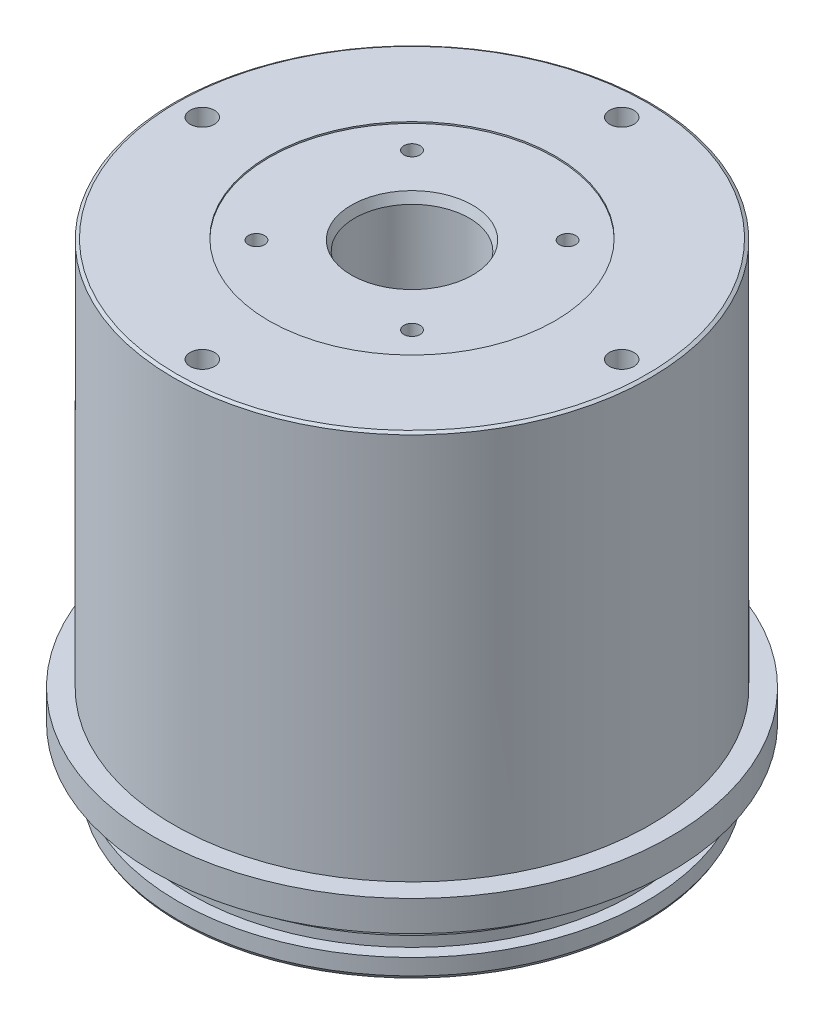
from build123d import *

# Parameters (mm, degrees)
SKETCH2_R          = 31.75
CUT_EXTRUDE1_DEPTH = 63.5
SKETCH3_R          = 9.525
CUT_EXTRUDE2_DEPTH = 101.037554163
SKETCH4_R          = 2.032
CUT_EXTRUDE3_DEPTH = 9.525
CIRPATTERN2_COUNT  = 8
SKETCH5_R          = 23.8125
CUT_EXTRUDE4_DEPTH = 0.254
SKETCH6_R          = 1.3462
CUT_EXTRUDE5_DEPTH = 9.525
CHAMFER2_SIZE      = 0.508
CHAMFER2_SIZE2     = 0.293293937
CHAMFER3_SIZE      = 1.5748
CHAMFER3_SIZE2     = 0.573180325
SKETCH8_R          = 2.032
CUT_EXTRUDE6_DEPTH = 9.525
CHAMFER4_SIZE      = 0.508
CHAMFER4_SIZE2     = 0.293293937
FILLET1_R          = 1.27


with BuildPart() as part:
    # Sketch1 → Revolve1 (revolve)
    with BuildSketch(Plane.XY, mode=Mode.PRIVATE) as revolve1_sk:
        Polygon((0, 0), (38.9255, 0), (38.9255, 3.175), (36.8681, 3.175), (36.8681, 6.35), (38.9255, 6.35), (38.9255, 9.525), (40.005, 9.525), (40.005, 10.668), (42.037, 10.668), (42.037, 9.525), (43.053, 9.525), (43.053, 14.605), (39.6748, 14.605), (39.6748, 79.375), (0, 79.375), align=None)
    revolve(revolve1_sk.sketch.rotate(Axis((0, 0, 0), (0, 1, 0)), 90), axis=Axis((0, 0, 0), (0, 1, 0)))

    # Sketch2 → Cut-Extrude1 (cut)
    with BuildSketch(Plane.XZ):
        with Locations(Location((0, 0, 0), (0, 0, 270))):
            Circle(SKETCH2_R)
    extrude(amount=-CUT_EXTRUDE1_DEPTH, mode=Mode.SUBTRACT)

    # Sketch3 → Cut-Extrude2 (cut, through all)
    with BuildSketch(Plane(origin=(0, 79.375, 0), x_dir=(1, 0, 0), z_dir=(0, 1, 0))):
        with Locations(Location((0, 0, 0), (0, 0, 270))):
            Circle(SKETCH3_R)
    extrude(amount=-CUT_EXTRUDE2_DEPTH, mode=Mode.SUBTRACT)

    # Sketch4 → Cut-Extrude3 (cut)
    with BuildSketch(Plane.XZ.offset(-63.5)):
        with Locations(Location((0, 25.4, 0), (0, 0, 270))):
            Circle(SKETCH4_R)
    cut_extrude3 = extrude(amount=-CUT_EXTRUDE3_DEPTH, mode=Mode.SUBTRACT)

    # CirPattern2: Cut-Extrude3 ×8 about axis
    cirpattern2_axis = Axis((0, 0, 0), (0, 1, 0))
    for i in range(1, CIRPATTERN2_COUNT):
        add(cut_extrude3.rotate(cirpattern2_axis, i * 360 / CIRPATTERN2_COUNT), mode=Mode.SUBTRACT)

    # Sketch5 → Cut-Extrude4 (cut)
    with BuildSketch(Plane(origin=(0, 79.375, 0), x_dir=(1, 0, 0), z_dir=(0, 1, 0))):
        with Locations(Location((0, 0, 0), (0, 0, 270))):
            Circle(SKETCH5_R)
    extrude(amount=-CUT_EXTRUDE4_DEPTH, mode=Mode.SUBTRACT)

    # Sketch6 → Cut-Extrude5 (cut)
    with BuildSketch(Plane(origin=(0, 79.121, 0), x_dir=(1, 0, 0), z_dir=(0, 1, 0))):
        with Locations(Location((12.954, 12.954, 0), (0, 0, 270))):
            Circle(SKETCH6_R)
        with Locations(Location((-12.954, 12.954, 0), (0, 0, 270))):
            Circle(SKETCH6_R)
        with Locations(Location((-12.954, -12.954, 0), (0, 0, 270))):
            Circle(SKETCH6_R)
        with Locations(Location((12.954, -12.954, 0), (0, 0, 270))):
            Circle(SKETCH6_R)
    extrude(amount=-CUT_EXTRUDE5_DEPTH, mode=Mode.SUBTRACT)

    # Chamfer2
    chamfer2_edges = [part.edges().sort_by_distance(p)[0] for p in [
        (0, 0, 38.9255),
    ]]
    chamfer2_side = [part.faces().sort_by_distance(p)[0] for p in [
        (0, 1.5875, 38.9255),
    ]]
    chamfer(chamfer2_edges, length=CHAMFER2_SIZE, length2=CHAMFER2_SIZE2, reference=chamfer2_side[0])

    # Chamfer3
    chamfer3_edges = [part.edges().sort_by_distance(p)[0] for p in [
        (0, 79.121, -9.525),
    ]]
    chamfer3_side = [part.faces().sort_by_distance(p)[0] for p in [
        (0, 71.3105, -9.525),
    ]]
    chamfer(chamfer3_edges, length=CHAMFER3_SIZE, length2=CHAMFER3_SIZE2, reference=chamfer3_side[0])

    # Sketch8 → Cut-Extrude6 (cut)
    with BuildSketch(Plane(origin=(0, 79.375, 0), x_dir=(1, 0, 0), z_dir=(0, 1, 0))):
        with Locations(Location((0, 34.925, 0), (0, 0, 270))):
            Circle(SKETCH8_R)
        with Locations(Location((-34.925, 0, 0), (0, 0, 270))):
            Circle(SKETCH8_R)
        with Locations(Location((34.925, 0, 0), (0, 0, 270))):
            Circle(SKETCH8_R)
        with Locations(Location((0, -34.925, 0), (0, 0, 270))):
            Circle(SKETCH8_R)
    extrude(amount=-CUT_EXTRUDE6_DEPTH, mode=Mode.SUBTRACT)

    # Chamfer4
    chamfer4_edges = [part.edges().sort_by_distance(p)[0] for p in [
        (0, 79.375, 39.6748),
    ]]
    chamfer4_side = [part.faces().sort_by_distance(p)[0] for p in [
        (0, 79.375, 38.552627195),
    ]]
    chamfer(chamfer4_edges, length=CHAMFER4_SIZE, length2=CHAMFER4_SIZE2, reference=chamfer4_side[0])

    # Fillet1
    fillet1_edges = [part.edges().sort_by_distance(p)[0] for p in [
        (0, 63.5, 31.75),
    ]]
    fillet(fillet1_edges, radius=FILLET1_R)


solid = part.part
